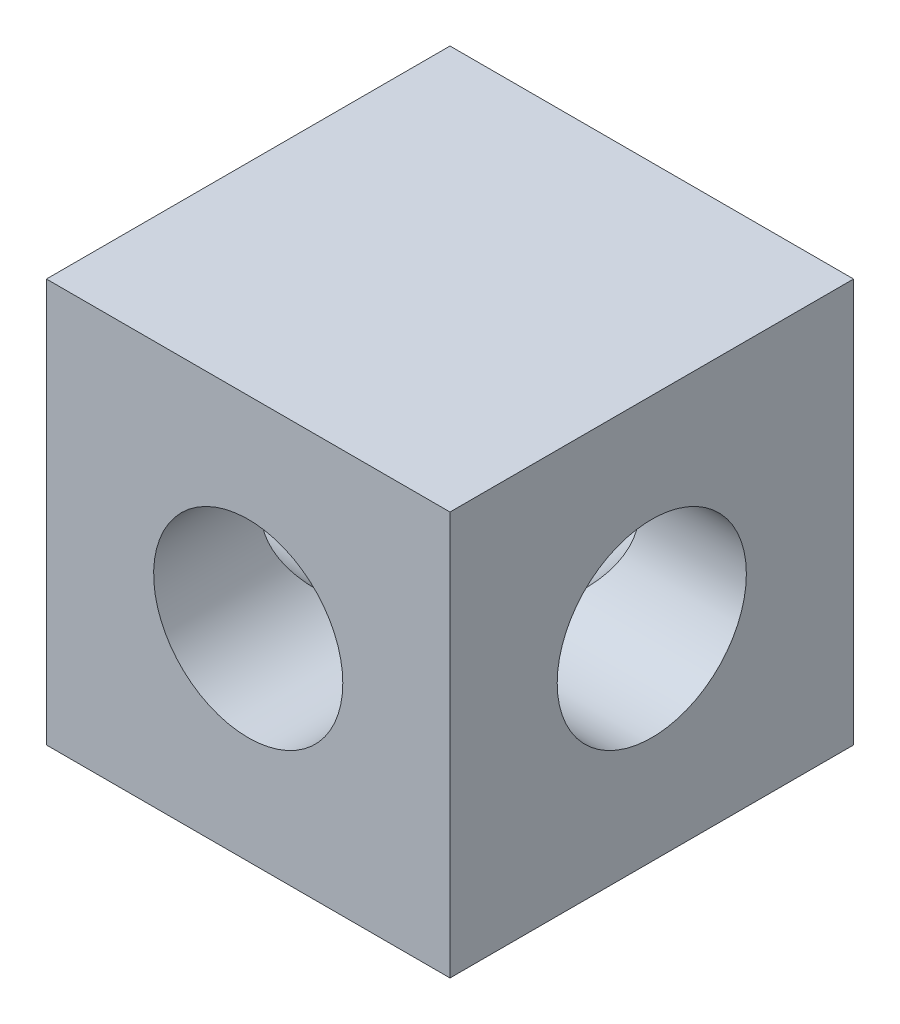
from build123d import *

# Parameters (mm, degrees)
SKETCH1_W          = 20.32
SKETCH1_H          = 20.32
SKETCH1_R          = 4.7625
BASE_EXTRUDE_DEPTH = 10.16
SKETCH3_R          = 4.7625
CUT_EXTRUDE1_DEPTH = 25.886815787


with BuildPart() as part:
    # Sketch1 → Base-Extrude (new, symmetric)
    with BuildSketch(Plane.XY):
        Rectangle(SKETCH1_W, SKETCH1_H)
        Circle(SKETCH1_R, mode=Mode.SUBTRACT)
    extrude(amount=BASE_EXTRUDE_DEPTH, both=True)

    # Sketch3 → Cut-Extrude1 (cut, through all)
    with BuildSketch(Plane(origin=(10.16, 0, 0), x_dir=(0, 0, -1), z_dir=(1, 0, 0))):
        Circle(SKETCH3_R)
    extrude(amount=-CUT_EXTRUDE1_DEPTH, mode=Mode.SUBTRACT)


solid = part.part
